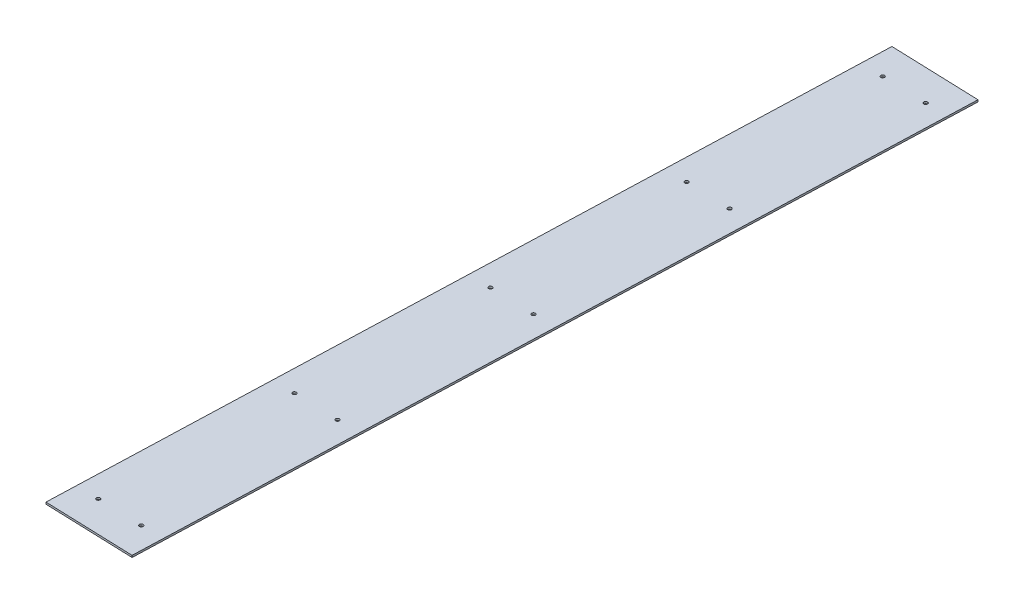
from build123d import *

# Parameters (mm, degrees)
SKETCH1_R           = 1.5875
BOSS_EXTRUDE1_DEPTH = 1.6256


with BuildPart() as part:
    # Sketch1 → Boss-Extrude1 (new body)
    with BuildSketch(Plane.XZ.offset(1.6256)):
        Polygon((-794.952495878, -1315.297563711), (-819.217650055, -617.219163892), (-743.063642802, -614.572056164), (-718.798488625, -1312.650455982), align=None)
        with Locations((-799.296778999, -641.942056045)):
            Circle(SKETCH1_R, mode=Mode.SUBTRACT)
        with Locations((-793.671675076, -803.769321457)):
            Circle(SKETCH1_R, mode=Mode.SUBTRACT)
        with Locations((-788.046571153, -965.596586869)):
            Circle(SKETCH1_R, mode=Mode.SUBTRACT)
        with Locations((-782.421467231, -1127.423852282)):
            Circle(SKETCH1_R, mode=Mode.SUBTRACT)
        with Locations((-776.796363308, -1289.251117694)):
            Circle(SKETCH1_R, mode=Mode.SUBTRACT)
        with Locations(Location((-761.219775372, -640.61850218, 0), (0, 0, 180))):
            Circle(SKETCH1_R, mode=Mode.SUBTRACT)
        with Locations(Location((-755.59467145, -802.445767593, 0), (0, 0, 180))):
            Circle(SKETCH1_R, mode=Mode.SUBTRACT)
        with Locations(Location((-749.969567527, -964.273033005, 0), (0, 0, 180))):
            Circle(SKETCH1_R, mode=Mode.SUBTRACT)
        with Locations(Location((-744.344463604, -1126.100298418, 0), (0, 0, 180))):
            Circle(SKETCH1_R, mode=Mode.SUBTRACT)
        with Locations(Location((-738.719359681, -1287.92756383, 0), (0, 0, 180))):
            Circle(SKETCH1_R, mode=Mode.SUBTRACT)
    extrude(amount=BOSS_EXTRUDE1_DEPTH)


solid = part.part
